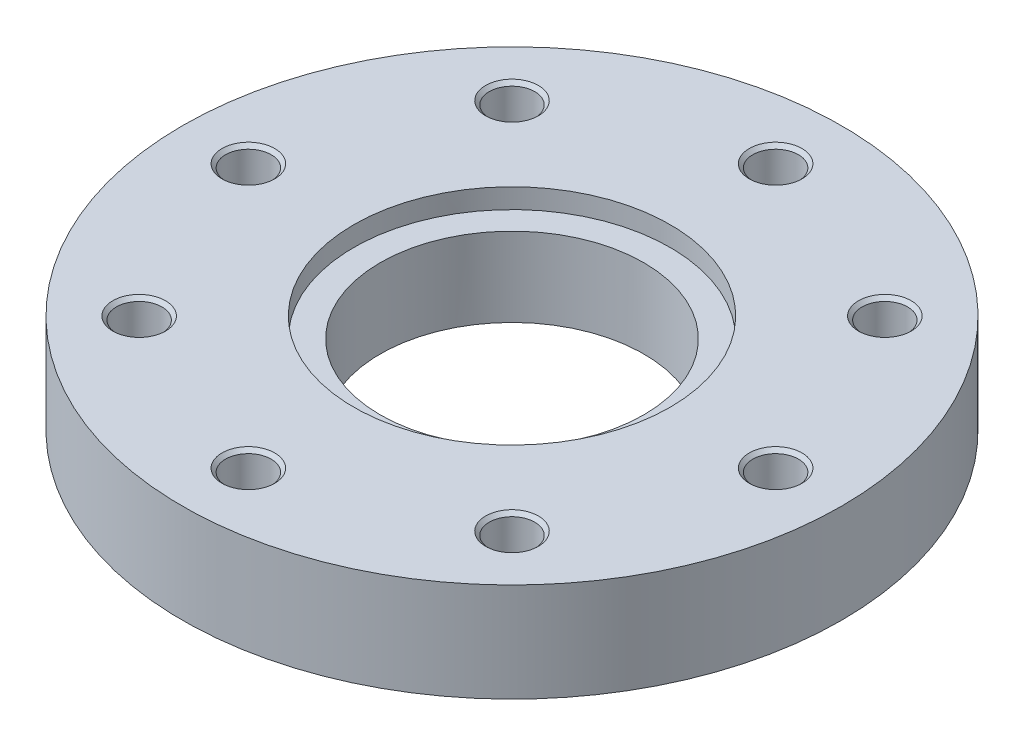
ISO-10303-21;
HEADER;
FILE_DESCRIPTION(('STEP AP214'),'2;1');
FILE_NAME('part.step','',(''),(''),'','','');
FILE_SCHEMA(('AUTOMOTIVE_DESIGN { 1 0 10303 214 1 1 1 1 }'));
ENDSEC;
DATA;
#1=APPLICATION_CONTEXT('core data for automotive mechanical design processes');
#2=APPLICATION_PROTOCOL_DEFINITION('international standard','automotive_design',2000,#1);
#3=PRODUCT_CONTEXT('',#1,'mechanical');
#4=PRODUCT('Part','Part','',(#3));
#5=PRODUCT_RELATED_PRODUCT_CATEGORY('part','',(#4));
#6=PRODUCT_DEFINITION_FORMATION('','',#4);
#7=PRODUCT_DEFINITION_CONTEXT('part definition',#1,'design');
#8=PRODUCT_DEFINITION('design','',#6,#7);
#9=PRODUCT_DEFINITION_SHAPE('','',#8);
#10=(LENGTH_UNIT() NAMED_UNIT(*) SI_UNIT(.MILLI.,.METRE.));
#11=(NAMED_UNIT(*) PLANE_ANGLE_UNIT() SI_UNIT($,.RADIAN.));
#12=(NAMED_UNIT(*) SI_UNIT($,.STERADIAN.) SOLID_ANGLE_UNIT());
#13=UNCERTAINTY_MEASURE_WITH_UNIT(LENGTH_MEASURE(1.E-05),#10,'distance_accuracy_value','');
#14=(GEOMETRIC_REPRESENTATION_CONTEXT(3) GLOBAL_UNCERTAINTY_ASSIGNED_CONTEXT((#13)) GLOBAL_UNIT_ASSIGNED_CONTEXT((#10,
#11,#12)) REPRESENTATION_CONTEXT('',''));
#15=CARTESIAN_POINT('',(0.,0.,0.));
#16=DIRECTION('',(0.,0.,1.));
#17=DIRECTION('',(1.,0.,0.));
#18=AXIS2_PLACEMENT_3D('',#15,#16,#17);
#19=CARTESIAN_POINT('',(0.,15.,0.));
#20=DIRECTION('',(0.,-1.,0.));
#21=DIRECTION('',(1.,0.,0.));
#22=AXIS2_PLACEMENT_3D('',#19,#20,#21);
#23=CYLINDRICAL_SURFACE('',#22,100.);
#24=CARTESIAN_POINT('',(0.,0.,0.));
#25=DIRECTION('',(0.,1.,0.));
#26=DIRECTION('',(1.,0.,0.));
#27=AXIS2_PLACEMENT_3D('',#24,#25,#26);
#28=CIRCLE('',#27,100.);
#29=CARTESIAN_POINT('',(100.,0.,0.));
#30=VERTEX_POINT('',#29);
#31=EDGE_CURVE('E9',#30,#30,#28,.T.);
#32=ORIENTED_EDGE('',*,*,#31,.T.);
#33=EDGE_LOOP('',(#32));
#34=FACE_BOUND('',#33,.T.);
#35=CARTESIAN_POINT('',(0.,30.,0.));
#36=DIRECTION('',(0.,1.,0.));
#37=DIRECTION('',(1.,0.,0.));
#38=AXIS2_PLACEMENT_3D('',#35,#36,#37);
#39=CIRCLE('',#38,100.);
#40=CARTESIAN_POINT('',(100.,30.,0.));
#41=VERTEX_POINT('',#40);
#42=EDGE_CURVE('E178',#41,#41,#39,.T.);
#43=ORIENTED_EDGE('',*,*,#42,.F.);
#44=EDGE_LOOP('',(#43));
#45=FACE_BOUND('',#44,.T.);
#46=ADVANCED_FACE('F15',(#34,#45),#23,.T.);
#47=CARTESIAN_POINT('',(70.,0.,0.));
#48=DIRECTION('',(0.,-1.,0.));
#49=DIRECTION('',(-1.,0.,0.));
#50=AXIS2_PLACEMENT_3D('',#47,#48,#49);
#51=PLANE('',#50);
#52=CARTESIAN_POINT('',(0.,0.,0.));
#53=DIRECTION('',(0.,1.,0.));
#54=DIRECTION('',(1.,0.,0.));
#55=AXIS2_PLACEMENT_3D('',#52,#53,#54);
#56=CIRCLE('',#55,40.);
#57=CARTESIAN_POINT('',(40.,0.,0.));
#58=VERTEX_POINT('',#57);
#59=EDGE_CURVE('E25',#58,#58,#56,.T.);
#60=ORIENTED_EDGE('',*,*,#59,.T.);
#61=EDGE_LOOP('',(#60));
#62=FACE_BOUND('',#61,.T.);
#63=ORIENTED_EDGE('',*,*,#31,.F.);
#64=EDGE_LOOP('',(#63));
#65=FACE_BOUND('',#64,.T.);
#66=ADVANCED_FACE('F269',(#62,#65),#51,.T.);
#67=CARTESIAN_POINT('',(0.,15.,0.));
#68=DIRECTION('',(0.,-1.,0.));
#69=DIRECTION('',(1.,0.,0.));
#70=AXIS2_PLACEMENT_3D('',#67,#68,#69);
#71=CYLINDRICAL_SURFACE('',#70,40.);
#72=ORIENTED_EDGE('',*,*,#59,.F.);
#73=EDGE_LOOP('',(#72));
#74=FACE_BOUND('',#73,.T.);
#75=CARTESIAN_POINT('',(0.,24.,0.));
#76=DIRECTION('',(0.,1.,0.));
#77=DIRECTION('',(1.,0.,0.));
#78=AXIS2_PLACEMENT_3D('',#75,#76,#77);
#79=CIRCLE('',#78,40.);
#80=CARTESIAN_POINT('',(-40.,24.,0.));
#81=VERTEX_POINT('',#80);
#82=EDGE_CURVE('E181',#81,#81,#79,.T.);
#83=ORIENTED_EDGE('',*,*,#82,.T.);
#84=EDGE_LOOP('',(#83));
#85=FACE_BOUND('',#84,.T.);
#86=ADVANCED_FACE('F274',(#74,#85),#71,.F.);
#87=CARTESIAN_POINT('',(70.,30.,0.));
#88=DIRECTION('',(0.,1.,0.));
#89=DIRECTION('',(1.,0.,0.));
#90=AXIS2_PLACEMENT_3D('',#87,#88,#89);
#91=PLANE('',#90);
#92=ORIENTED_EDGE('',*,*,#42,.T.);
#93=EDGE_LOOP('',(#92));
#94=FACE_BOUND('',#93,.T.);
#95=CARTESIAN_POINT('',(0.,30.,0.));
#96=DIRECTION('',(0.,-1.,0.));
#97=DIRECTION('',(1.,0.,0.));
#98=AXIS2_PLACEMENT_3D('',#95,#96,#97);
#99=CIRCLE('',#98,48.);
#100=CARTESIAN_POINT('',(-48.,30.,0.));
#101=VERTEX_POINT('',#100);
#102=EDGE_CURVE('E222',#101,#101,#99,.T.);
#103=ORIENTED_EDGE('',*,*,#102,.T.);
#104=EDGE_LOOP('',(#103));
#105=FACE_BOUND('',#104,.T.);
#106=CARTESIAN_POINT('',(80.,30.,0.));
#107=DIRECTION('',(0.,-1.,0.));
#108=DIRECTION('',(1.,0.,0.));
#109=AXIS2_PLACEMENT_3D('',#106,#107,#108);
#110=CIRCLE('',#109,8.);
#111=CARTESIAN_POINT('',(88.,30.,0.));
#112=VERTEX_POINT('',#111);
#113=EDGE_CURVE('E173',#112,#112,#110,.T.);
#114=ORIENTED_EDGE('',*,*,#113,.T.);
#115=EDGE_LOOP('',(#114));
#116=FACE_BOUND('',#115,.T.);
#117=CARTESIAN_POINT('',(56.5685424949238,30.,-56.5685424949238));
#118=DIRECTION('',(0.,-1.,0.));
#119=DIRECTION('',(0.707106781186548,0.,-0.707106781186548));
#120=AXIS2_PLACEMENT_3D('',#117,#118,#119);
#121=CIRCLE('',#120,8.);
#122=CARTESIAN_POINT('',(62.2253967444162,30.,-62.2253967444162));
#123=VERTEX_POINT('',#122);
#124=EDGE_CURVE('E137',#123,#123,#121,.T.);
#125=ORIENTED_EDGE('',*,*,#124,.T.);
#126=EDGE_LOOP('',(#125));
#127=FACE_BOUND('',#126,.T.);
#128=CARTESIAN_POINT('',(0.,30.,-80.));
#129=DIRECTION('',(0.,-1.,0.));
#130=DIRECTION('',(0.,0.,-1.));
#131=AXIS2_PLACEMENT_3D('',#128,#129,#130);
#132=CIRCLE('',#131,8.);
#133=CARTESIAN_POINT('',(0.,30.,-88.));
#134=VERTEX_POINT('',#133);
#135=EDGE_CURVE('E241',#134,#134,#132,.T.);
#136=ORIENTED_EDGE('',*,*,#135,.T.);
#137=EDGE_LOOP('',(#136));
#138=FACE_BOUND('',#137,.T.);
#139=CARTESIAN_POINT('',(-56.5685424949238,30.,-56.5685424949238));
#140=DIRECTION('',(0.,-1.,0.));
#141=DIRECTION('',(-0.707106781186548,0.,-0.707106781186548));
#142=AXIS2_PLACEMENT_3D('',#139,#140,#141);
#143=CIRCLE('',#142,8.);
#144=CARTESIAN_POINT('',(-62.2253967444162,30.,-62.2253967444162));
#145=VERTEX_POINT('',#144);
#146=EDGE_CURVE('E195',#145,#145,#143,.T.);
#147=ORIENTED_EDGE('',*,*,#146,.T.);
#148=EDGE_LOOP('',(#147));
#149=FACE_BOUND('',#148,.T.);
#150=CARTESIAN_POINT('',(-80.,30.,0.));
#151=DIRECTION('',(0.,-1.,0.));
#152=DIRECTION('',(-1.,0.,0.));
#153=AXIS2_PLACEMENT_3D('',#150,#151,#152);
#154=CIRCLE('',#153,8.);
#155=CARTESIAN_POINT('',(-88.,30.,0.));
#156=VERTEX_POINT('',#155);
#157=EDGE_CURVE('E489',#156,#156,#154,.T.);
#158=ORIENTED_EDGE('',*,*,#157,.T.);
#159=EDGE_LOOP('',(#158));
#160=FACE_BOUND('',#159,.T.);
#161=CARTESIAN_POINT('',(-56.5685424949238,30.,56.5685424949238));
#162=DIRECTION('',(0.,-1.,0.));
#163=DIRECTION('',(-0.707106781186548,0.,0.707106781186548));
#164=AXIS2_PLACEMENT_3D('',#161,#162,#163);
#165=CIRCLE('',#164,8.);
#166=CARTESIAN_POINT('',(-62.2253967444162,30.,62.2253967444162));
#167=VERTEX_POINT('',#166);
#168=EDGE_CURVE('E161',#167,#167,#165,.T.);
#169=ORIENTED_EDGE('',*,*,#168,.T.);
#170=EDGE_LOOP('',(#169));
#171=FACE_BOUND('',#170,.T.);
#172=CARTESIAN_POINT('',(0.,30.,80.));
#173=DIRECTION('',(0.,-1.,0.));
#174=DIRECTION('',(0.,0.,1.));
#175=AXIS2_PLACEMENT_3D('',#172,#173,#174);
#176=CIRCLE('',#175,8.);
#177=CARTESIAN_POINT('',(0.,30.,88.));
#178=VERTEX_POINT('',#177);
#179=EDGE_CURVE('E147',#178,#178,#176,.T.);
#180=ORIENTED_EDGE('',*,*,#179,.T.);
#181=EDGE_LOOP('',(#180));
#182=FACE_BOUND('',#181,.T.);
#183=CARTESIAN_POINT('',(56.5685424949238,30.,56.5685424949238));
#184=DIRECTION('',(0.,-1.,0.));
#185=DIRECTION('',(0.707106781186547,0.,0.707106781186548));
#186=AXIS2_PLACEMENT_3D('',#183,#184,#185);
#187=CIRCLE('',#186,8.);
#188=CARTESIAN_POINT('',(62.2253967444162,30.,62.2253967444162));
#189=VERTEX_POINT('',#188);
#190=EDGE_CURVE('E155',#189,#189,#187,.T.);
#191=ORIENTED_EDGE('',*,*,#190,.T.);
#192=EDGE_LOOP('',(#191));
#193=FACE_BOUND('',#192,.T.);
#194=ADVANCED_FACE('F393',(#94,#105,#116,#127,#138,#149,#160,#171,#182,#193),#91,.T.);
#195=CARTESIAN_POINT('',(0.,24.,0.));
#196=DIRECTION('',(0.,-1.,0.));
#197=DIRECTION('',(-1.,0.,0.));
#198=AXIS2_PLACEMENT_3D('',#195,#196,#197);
#199=PLANE('',#198);
#200=CARTESIAN_POINT('',(0.,24.,0.));
#201=DIRECTION('',(0.,-1.,0.));
#202=DIRECTION('',(1.,0.,0.));
#203=AXIS2_PLACEMENT_3D('',#200,#201,#202);
#204=CIRCLE('',#203,48.);
#205=CARTESIAN_POINT('',(48.,24.,0.));
#206=VERTEX_POINT('',#205);
#207=EDGE_CURVE('E225',#206,#206,#204,.T.);
#208=ORIENTED_EDGE('',*,*,#207,.F.);
#209=EDGE_LOOP('',(#208));
#210=FACE_BOUND('',#209,.T.);
#211=ORIENTED_EDGE('',*,*,#82,.F.);
#212=EDGE_LOOP('',(#211));
#213=FACE_BOUND('',#212,.T.);
#214=ADVANCED_FACE('F427',(#210,#213),#199,.F.);
#215=CARTESIAN_POINT('',(0.,28.5,0.));
#216=DIRECTION('',(0.,-1.,0.));
#217=DIRECTION('',(1.,0.,0.));
#218=AXIS2_PLACEMENT_3D('',#215,#216,#217);
#219=CYLINDRICAL_SURFACE('',#218,48.);
#220=ORIENTED_EDGE('',*,*,#207,.T.);
#221=EDGE_LOOP('',(#220));
#222=FACE_BOUND('',#221,.T.);
#223=ORIENTED_EDGE('',*,*,#102,.F.);
#224=EDGE_LOOP('',(#223));
#225=FACE_BOUND('',#224,.T.);
#226=ADVANCED_FACE('F402',(#222,#225),#219,.F.);
#227=CARTESIAN_POINT('',(80.,5.00308975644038,0.));
#228=DIRECTION('',(0.,1.,0.));
#229=DIRECTION('',(1.,0.,0.));
#230=AXIS2_PLACEMENT_3D('',#227,#228,#229);
#231=CONICAL_SURFACE('',#230,3.45875,1.0471975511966);
#232=CARTESIAN_POINT('',(80.,7.,0.));
#233=DIRECTION('',(0.,-1.,0.));
#234=DIRECTION('',(1.,0.,0.));
#235=AXIS2_PLACEMENT_3D('',#232,#233,#234);
#236=CIRCLE('',#235,6.9175);
#237=CARTESIAN_POINT('',(86.9175,7.,0.));
#238=VERTEX_POINT('',#237);
#239=EDGE_CURVE('E219',#238,#238,#236,.T.);
#240=ORIENTED_EDGE('',*,*,#239,.F.);
#241=EDGE_LOOP('',(#240));
#242=FACE_BOUND('',#241,.T.);
#243=CARTESIAN_POINT('',(80.,3.00617951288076,0.));
#244=VERTEX_POINT('',#243);
#245=VERTEX_LOOP('',#244);
#246=FACE_BOUND('',#245,.T.);
#247=ADVANCED_FACE('F399',(#242,#246),#231,.F.);
#248=CARTESIAN_POINT('',(80.,9.95875,0.));
#249=DIRECTION('',(0.,1.,0.));
#250=DIRECTION('',(1.,0.,0.));
#251=AXIS2_PLACEMENT_3D('',#248,#249,#250);
#252=CYLINDRICAL_SURFACE('',#251,6.9175);
#253=CARTESIAN_POINT('',(80.,12.9175,0.));
#254=DIRECTION('',(0.,-1.,0.));
#255=DIRECTION('',(1.,0.,0.));
#256=AXIS2_PLACEMENT_3D('',#253,#254,#255);
#257=CIRCLE('',#256,6.9175);
#258=CARTESIAN_POINT('',(86.9175,12.9175,0.));
#259=VERTEX_POINT('',#258);
#260=EDGE_CURVE('E223',#259,#259,#257,.T.);
#261=ORIENTED_EDGE('',*,*,#260,.F.);
#262=EDGE_LOOP('',(#261));
#263=FACE_BOUND('',#262,.T.);
#264=ORIENTED_EDGE('',*,*,#239,.T.);
#265=EDGE_LOOP('',(#264));
#266=FACE_BOUND('',#265,.T.);
#267=ADVANCED_FACE('F401',(#263,#266),#252,.F.);
#268=CARTESIAN_POINT('',(80.,13.45875,0.));
#269=DIRECTION('',(0.,1.,0.));
#270=DIRECTION('',(1.,0.,0.));
#271=AXIS2_PLACEMENT_3D('',#268,#269,#270);
#272=CONICAL_SURFACE('',#271,7.45875,0.785398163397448);
#273=CARTESIAN_POINT('',(80.,14.,0.));
#274=DIRECTION('',(0.,-1.,0.));
#275=DIRECTION('',(1.,0.,0.));
#276=AXIS2_PLACEMENT_3D('',#273,#274,#275);
#277=CIRCLE('',#276,8.);
#278=CARTESIAN_POINT('',(88.,14.,0.));
#279=VERTEX_POINT('',#278);
#280=EDGE_CURVE('E213',#279,#279,#277,.T.);
#281=ORIENTED_EDGE('',*,*,#280,.F.);
#282=EDGE_LOOP('',(#281));
#283=FACE_BOUND('',#282,.T.);
#284=ORIENTED_EDGE('',*,*,#260,.T.);
#285=EDGE_LOOP('',(#284));
#286=FACE_BOUND('',#285,.T.);
#287=ADVANCED_FACE('F383',(#283,#286),#272,.F.);
#288=CARTESIAN_POINT('',(87.45875,14.,0.));
#289=DIRECTION('',(0.,1.,0.));
#290=DIRECTION('',(-1.,0.,0.));
#291=AXIS2_PLACEMENT_3D('',#288,#289,#290);
#292=PLANE('',#291);
#293=CARTESIAN_POINT('',(80.,14.,0.));
#294=DIRECTION('',(0.,-1.,0.));
#295=DIRECTION('',(1.,0.,0.));
#296=AXIS2_PLACEMENT_3D('',#293,#294,#295);
#297=CIRCLE('',#296,6.9175);
#298=CARTESIAN_POINT('',(86.9175,14.,0.));
#299=VERTEX_POINT('',#298);
#300=EDGE_CURVE('E176',#299,#299,#297,.T.);
#301=ORIENTED_EDGE('',*,*,#300,.F.);
#302=EDGE_LOOP('',(#301));
#303=FACE_BOUND('',#302,.T.);
#304=ORIENTED_EDGE('',*,*,#280,.T.);
#305=EDGE_LOOP('',(#304));
#306=FACE_BOUND('',#305,.T.);
#307=ADVANCED_FACE('F285',(#303,#306),#292,.F.);
#308=CARTESIAN_POINT('',(80.,21.45875,0.));
#309=DIRECTION('',(0.,1.,0.));
#310=DIRECTION('',(1.,0.,0.));
#311=AXIS2_PLACEMENT_3D('',#308,#309,#310);
#312=CYLINDRICAL_SURFACE('',#311,6.9175);
#313=CARTESIAN_POINT('',(80.,28.9175,0.));
#314=DIRECTION('',(0.,-1.,0.));
#315=DIRECTION('',(1.,0.,0.));
#316=AXIS2_PLACEMENT_3D('',#313,#314,#315);
#317=CIRCLE('',#316,6.9175);
#318=CARTESIAN_POINT('',(86.9175,28.9175,0.));
#319=VERTEX_POINT('',#318);
#320=EDGE_CURVE('E177',#319,#319,#317,.T.);
#321=ORIENTED_EDGE('',*,*,#320,.F.);
#322=EDGE_LOOP('',(#321));
#323=FACE_BOUND('',#322,.T.);
#324=ORIENTED_EDGE('',*,*,#300,.T.);
#325=EDGE_LOOP('',(#324));
#326=FACE_BOUND('',#325,.T.);
#327=ADVANCED_FACE('F282',(#323,#326),#312,.F.);
#328=CARTESIAN_POINT('',(80.,29.45875,0.));
#329=DIRECTION('',(0.,1.,0.));
#330=DIRECTION('',(1.,0.,0.));
#331=AXIS2_PLACEMENT_3D('',#328,#329,#330);
#332=CONICAL_SURFACE('',#331,7.45875,0.785398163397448);
#333=ORIENTED_EDGE('',*,*,#113,.F.);
#334=EDGE_LOOP('',(#333));
#335=FACE_BOUND('',#334,.T.);
#336=ORIENTED_EDGE('',*,*,#320,.T.);
#337=EDGE_LOOP('',(#336));
#338=FACE_BOUND('',#337,.T.);
#339=ADVANCED_FACE('F284',(#335,#338),#332,.F.);
#340=CARTESIAN_POINT('',(56.5685424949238,5.00308975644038,-56.5685424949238));
#341=DIRECTION('',(0.,1.,0.));
#342=DIRECTION('',(0.707106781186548,0.,-0.707106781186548));
#343=AXIS2_PLACEMENT_3D('',#340,#341,#342);
#344=CONICAL_SURFACE('',#343,3.45875,1.0471975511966);
#345=CARTESIAN_POINT('',(56.5685424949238,7.,-56.5685424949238));
#346=DIRECTION('',(0.,-1.,0.));
#347=DIRECTION('',(0.707106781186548,0.,-0.707106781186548));
#348=AXIS2_PLACEMENT_3D('',#345,#346,#347);
#349=CIRCLE('',#348,6.9175);
#350=CARTESIAN_POINT('',(61.4599536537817,7.,-61.4599536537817));
#351=VERTEX_POINT('',#350);
#352=EDGE_CURVE('E190',#351,#351,#349,.T.);
#353=ORIENTED_EDGE('',*,*,#352,.F.);
#354=EDGE_LOOP('',(#353));
#355=FACE_BOUND('',#354,.T.);
#356=CARTESIAN_POINT('',(56.5685424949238,3.00617951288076,-56.5685424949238));
#357=VERTEX_POINT('',#356);
#358=VERTEX_LOOP('',#357);
#359=FACE_BOUND('',#358,.T.);
#360=ADVANCED_FACE('F441',(#355,#359),#344,.F.);
#361=CARTESIAN_POINT('',(56.5685424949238,9.95875,-56.5685424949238));
#362=DIRECTION('',(0.,1.,0.));
#363=DIRECTION('',(0.707106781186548,0.,-0.707106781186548));
#364=AXIS2_PLACEMENT_3D('',#361,#362,#363);
#365=CYLINDRICAL_SURFACE('',#364,6.9175);
#366=CARTESIAN_POINT('',(56.5685424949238,12.9175,-56.5685424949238));
#367=DIRECTION('',(0.,-1.,0.));
#368=DIRECTION('',(0.707106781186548,0.,-0.707106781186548));
#369=AXIS2_PLACEMENT_3D('',#366,#367,#368);
#370=CIRCLE('',#369,6.9175);
#371=CARTESIAN_POINT('',(61.4599536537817,12.9175,-61.4599536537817));
#372=VERTEX_POINT('',#371);
#373=EDGE_CURVE('E139',#372,#372,#370,.T.);
#374=ORIENTED_EDGE('',*,*,#373,.F.);
#375=EDGE_LOOP('',(#374));
#376=FACE_BOUND('',#375,.T.);
#377=ORIENTED_EDGE('',*,*,#352,.T.);
#378=EDGE_LOOP('',(#377));
#379=FACE_BOUND('',#378,.T.);
#380=ADVANCED_FACE('F413',(#376,#379),#365,.F.);
#381=CARTESIAN_POINT('',(56.5685424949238,13.45875,-56.5685424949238));
#382=DIRECTION('',(0.,1.,0.));
#383=DIRECTION('',(0.707106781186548,0.,-0.707106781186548));
#384=AXIS2_PLACEMENT_3D('',#381,#382,#383);
#385=CONICAL_SURFACE('',#384,7.45875,0.785398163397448);
#386=CARTESIAN_POINT('',(56.5685424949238,14.,-56.5685424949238));
#387=DIRECTION('',(0.,-1.,0.));
#388=DIRECTION('',(0.707106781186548,0.,-0.707106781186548));
#389=AXIS2_PLACEMENT_3D('',#386,#387,#388);
#390=CIRCLE('',#389,8.);
#391=CARTESIAN_POINT('',(62.2253967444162,14.,-62.2253967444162));
#392=VERTEX_POINT('',#391);
#393=EDGE_CURVE('E136',#392,#392,#390,.T.);
#394=ORIENTED_EDGE('',*,*,#393,.F.);
#395=EDGE_LOOP('',(#394));
#396=FACE_BOUND('',#395,.T.);
#397=ORIENTED_EDGE('',*,*,#373,.T.);
#398=EDGE_LOOP('',(#397));
#399=FACE_BOUND('',#398,.T.);
#400=ADVANCED_FACE('F375',(#396,#399),#385,.F.);
#401=CARTESIAN_POINT('',(61.842675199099,14.,-61.842675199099));
#402=DIRECTION('',(0.,1.,0.));
#403=DIRECTION('',(-0.707106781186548,0.,0.707106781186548));
#404=AXIS2_PLACEMENT_3D('',#401,#402,#403);
#405=PLANE('',#404);
#406=CARTESIAN_POINT('',(56.5685424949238,14.,-56.5685424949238));
#407=DIRECTION('',(0.,-1.,0.));
#408=DIRECTION('',(0.707106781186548,0.,-0.707106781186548));
#409=AXIS2_PLACEMENT_3D('',#406,#407,#408);
#410=CIRCLE('',#409,6.9175);
#411=CARTESIAN_POINT('',(61.4599536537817,14.,-61.4599536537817));
#412=VERTEX_POINT('',#411);
#413=EDGE_CURVE('E133',#412,#412,#410,.T.);
#414=ORIENTED_EDGE('',*,*,#413,.F.);
#415=EDGE_LOOP('',(#414));
#416=FACE_BOUND('',#415,.T.);
#417=ORIENTED_EDGE('',*,*,#393,.T.);
#418=EDGE_LOOP('',(#417));
#419=FACE_BOUND('',#418,.T.);
#420=ADVANCED_FACE('F367',(#416,#419),#405,.F.);
#421=CARTESIAN_POINT('',(56.5685424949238,21.45875,-56.5685424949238));
#422=DIRECTION('',(0.,1.,0.));
#423=DIRECTION('',(0.707106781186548,0.,-0.707106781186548));
#424=AXIS2_PLACEMENT_3D('',#421,#422,#423);
#425=CYLINDRICAL_SURFACE('',#424,6.9175);
#426=CARTESIAN_POINT('',(56.5685424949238,28.9175,-56.5685424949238));
#427=DIRECTION('',(0.,-1.,0.));
#428=DIRECTION('',(0.707106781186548,0.,-0.707106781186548));
#429=AXIS2_PLACEMENT_3D('',#426,#427,#428);
#430=CIRCLE('',#429,6.9175);
#431=CARTESIAN_POINT('',(61.4599536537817,28.9175,-61.4599536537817));
#432=VERTEX_POINT('',#431);
#433=EDGE_CURVE('E141',#432,#432,#430,.T.);
#434=ORIENTED_EDGE('',*,*,#433,.F.);
#435=EDGE_LOOP('',(#434));
#436=FACE_BOUND('',#435,.T.);
#437=ORIENTED_EDGE('',*,*,#413,.T.);
#438=EDGE_LOOP('',(#437));
#439=FACE_BOUND('',#438,.T.);
#440=ADVANCED_FACE('F134',(#436,#439),#425,.F.);
#441=CARTESIAN_POINT('',(56.5685424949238,29.45875,-56.5685424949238));
#442=DIRECTION('',(0.,1.,0.));
#443=DIRECTION('',(0.707106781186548,0.,-0.707106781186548));
#444=AXIS2_PLACEMENT_3D('',#441,#442,#443);
#445=CONICAL_SURFACE('',#444,7.45875,0.785398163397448);
#446=ORIENTED_EDGE('',*,*,#124,.F.);
#447=EDGE_LOOP('',(#446));
#448=FACE_BOUND('',#447,.T.);
#449=ORIENTED_EDGE('',*,*,#433,.T.);
#450=EDGE_LOOP('',(#449));
#451=FACE_BOUND('',#450,.T.);
#452=ADVANCED_FACE('F364',(#448,#451),#445,.F.);
#453=CARTESIAN_POINT('',(0.,5.00308975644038,-80.));
#454=DIRECTION('',(0.,1.,0.));
#455=DIRECTION('',(0.,0.,-1.));
#456=AXIS2_PLACEMENT_3D('',#453,#454,#455);
#457=CONICAL_SURFACE('',#456,3.45875,1.0471975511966);
#458=CARTESIAN_POINT('',(0.,7.,-80.));
#459=DIRECTION('',(0.,-1.,0.));
#460=DIRECTION('',(0.,0.,-1.));
#461=AXIS2_PLACEMENT_3D('',#458,#459,#460);
#462=CIRCLE('',#461,6.9175);
#463=CARTESIAN_POINT('',(0.,7.,-86.9175));
#464=VERTEX_POINT('',#463);
#465=EDGE_CURVE('E216',#464,#464,#462,.T.);
#466=ORIENTED_EDGE('',*,*,#465,.F.);
#467=EDGE_LOOP('',(#466));
#468=FACE_BOUND('',#467,.T.);
#469=CARTESIAN_POINT('',(0.,3.00617951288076,-80.));
#470=VERTEX_POINT('',#469);
#471=VERTEX_LOOP('',#470);
#472=FACE_BOUND('',#471,.T.);
#473=ADVANCED_FACE('F373',(#468,#472),#457,.F.);
#474=CARTESIAN_POINT('',(0.,9.95875,-80.));
#475=DIRECTION('',(0.,1.,0.));
#476=DIRECTION('',(0.,0.,-1.));
#477=AXIS2_PLACEMENT_3D('',#474,#475,#476);
#478=CYLINDRICAL_SURFACE('',#477,6.9175);
#479=CARTESIAN_POINT('',(0.,12.9175,-80.));
#480=DIRECTION('',(0.,-1.,0.));
#481=DIRECTION('',(0.,0.,-1.));
#482=AXIS2_PLACEMENT_3D('',#479,#480,#481);
#483=CIRCLE('',#482,6.9175);
#484=CARTESIAN_POINT('',(0.,12.9175,-86.9175));
#485=VERTEX_POINT('',#484);
#486=EDGE_CURVE('E171',#485,#485,#483,.T.);
#487=ORIENTED_EDGE('',*,*,#486,.F.);
#488=EDGE_LOOP('',(#487));
#489=FACE_BOUND('',#488,.T.);
#490=ORIENTED_EDGE('',*,*,#465,.T.);
#491=EDGE_LOOP('',(#490));
#492=FACE_BOUND('',#491,.T.);
#493=ADVANCED_FACE('F445',(#489,#492),#478,.F.);
#494=CARTESIAN_POINT('',(0.,13.45875,-80.));
#495=DIRECTION('',(0.,1.,0.));
#496=DIRECTION('',(0.,0.,-1.));
#497=AXIS2_PLACEMENT_3D('',#494,#495,#496);
#498=CONICAL_SURFACE('',#497,7.45875,0.785398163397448);
#499=CARTESIAN_POINT('',(0.,14.,-80.));
#500=DIRECTION('',(0.,-1.,0.));
#501=DIRECTION('',(0.,0.,-1.));
#502=AXIS2_PLACEMENT_3D('',#499,#500,#501);
#503=CIRCLE('',#502,8.);
#504=CARTESIAN_POINT('',(0.,14.,-88.));
#505=VERTEX_POINT('',#504);
#506=EDGE_CURVE('E169',#505,#505,#503,.T.);
#507=ORIENTED_EDGE('',*,*,#506,.F.);
#508=EDGE_LOOP('',(#507));
#509=FACE_BOUND('',#508,.T.);
#510=ORIENTED_EDGE('',*,*,#486,.T.);
#511=EDGE_LOOP('',(#510));
#512=FACE_BOUND('',#511,.T.);
#513=ADVANCED_FACE('F545',(#509,#512),#498,.F.);
#514=CARTESIAN_POINT('',(0.,14.,-87.45875));
#515=DIRECTION('',(0.,1.,0.));
#516=DIRECTION('',(0.,0.,1.));
#517=AXIS2_PLACEMENT_3D('',#514,#515,#516);
#518=PLANE('',#517);
#519=CARTESIAN_POINT('',(0.,14.,-80.));
#520=DIRECTION('',(0.,-1.,0.));
#521=DIRECTION('',(0.,0.,-1.));
#522=AXIS2_PLACEMENT_3D('',#519,#520,#521);
#523=CIRCLE('',#522,6.9175);
#524=CARTESIAN_POINT('',(0.,14.,-86.9175));
#525=VERTEX_POINT('',#524);
#526=EDGE_CURVE('E172',#525,#525,#523,.T.);
#527=ORIENTED_EDGE('',*,*,#526,.F.);
#528=EDGE_LOOP('',(#527));
#529=FACE_BOUND('',#528,.T.);
#530=ORIENTED_EDGE('',*,*,#506,.T.);
#531=EDGE_LOOP('',(#530));
#532=FACE_BOUND('',#531,.T.);
#533=ADVANCED_FACE('F541',(#529,#532),#518,.F.);
#534=CARTESIAN_POINT('',(0.,21.45875,-80.));
#535=DIRECTION('',(0.,1.,0.));
#536=DIRECTION('',(0.,0.,-1.));
#537=AXIS2_PLACEMENT_3D('',#534,#535,#536);
#538=CYLINDRICAL_SURFACE('',#537,6.9175);
#539=CARTESIAN_POINT('',(0.,28.9175,-80.));
#540=DIRECTION('',(0.,-1.,0.));
#541=DIRECTION('',(0.,0.,-1.));
#542=AXIS2_PLACEMENT_3D('',#539,#540,#541);
#543=CIRCLE('',#542,6.9175);
#544=CARTESIAN_POINT('',(0.,28.9175,-86.9175));
#545=VERTEX_POINT('',#544);
#546=EDGE_CURVE('E234',#545,#545,#543,.T.);
#547=ORIENTED_EDGE('',*,*,#546,.F.);
#548=EDGE_LOOP('',(#547));
#549=FACE_BOUND('',#548,.T.);
#550=ORIENTED_EDGE('',*,*,#526,.T.);
#551=EDGE_LOOP('',(#550));
#552=FACE_BOUND('',#551,.T.);
#553=ADVANCED_FACE('F538',(#549,#552),#538,.F.);
#554=CARTESIAN_POINT('',(0.,29.45875,-80.));
#555=DIRECTION('',(0.,1.,0.));
#556=DIRECTION('',(0.,0.,-1.));
#557=AXIS2_PLACEMENT_3D('',#554,#555,#556);
#558=CONICAL_SURFACE('',#557,7.45875,0.785398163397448);
#559=ORIENTED_EDGE('',*,*,#135,.F.);
#560=EDGE_LOOP('',(#559));
#561=FACE_BOUND('',#560,.T.);
#562=ORIENTED_EDGE('',*,*,#546,.T.);
#563=EDGE_LOOP('',(#562));
#564=FACE_BOUND('',#563,.T.);
#565=ADVANCED_FACE('F511',(#561,#564),#558,.F.);
#566=CARTESIAN_POINT('',(-56.5685424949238,5.00308975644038,-56.5685424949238));
#567=DIRECTION('',(0.,1.,0.));
#568=DIRECTION('',(-0.707106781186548,0.,-0.707106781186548));
#569=AXIS2_PLACEMENT_3D('',#566,#567,#568);
#570=CONICAL_SURFACE('',#569,3.45875,1.0471975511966);
#571=CARTESIAN_POINT('',(-56.5685424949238,7.,-56.5685424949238));
#572=DIRECTION('',(0.,-1.,0.));
#573=DIRECTION('',(-0.707106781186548,0.,-0.707106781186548));
#574=AXIS2_PLACEMENT_3D('',#571,#572,#573);
#575=CIRCLE('',#574,6.9175);
#576=CARTESIAN_POINT('',(-61.4599536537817,7.,-61.4599536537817));
#577=VERTEX_POINT('',#576);
#578=EDGE_CURVE('E231',#577,#577,#575,.T.);
#579=ORIENTED_EDGE('',*,*,#578,.F.);
#580=EDGE_LOOP('',(#579));
#581=FACE_BOUND('',#580,.T.);
#582=CARTESIAN_POINT('',(-56.5685424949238,3.00617951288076,-56.5685424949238));
#583=VERTEX_POINT('',#582);
#584=VERTEX_LOOP('',#583);
#585=FACE_BOUND('',#584,.T.);
#586=ADVANCED_FACE('F507',(#581,#585),#570,.F.);
#587=CARTESIAN_POINT('',(-56.5685424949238,9.95875,-56.5685424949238));
#588=DIRECTION('',(0.,1.,0.));
#589=DIRECTION('',(-0.707106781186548,0.,-0.707106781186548));
#590=AXIS2_PLACEMENT_3D('',#587,#588,#589);
#591=CYLINDRICAL_SURFACE('',#590,6.9175);
#592=CARTESIAN_POINT('',(-56.5685424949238,12.9175,-56.5685424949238));
#593=DIRECTION('',(0.,-1.,0.));
#594=DIRECTION('',(-0.707106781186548,0.,-0.707106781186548));
#595=AXIS2_PLACEMENT_3D('',#592,#593,#594);
#596=CIRCLE('',#595,6.9175);
#597=CARTESIAN_POINT('',(-61.4599536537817,12.9175,-61.4599536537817));
#598=VERTEX_POINT('',#597);
#599=EDGE_CURVE('E228',#598,#598,#596,.T.);
#600=ORIENTED_EDGE('',*,*,#599,.F.);
#601=EDGE_LOOP('',(#600));
#602=FACE_BOUND('',#601,.T.);
#603=ORIENTED_EDGE('',*,*,#578,.T.);
#604=EDGE_LOOP('',(#603));
#605=FACE_BOUND('',#604,.T.);
#606=ADVANCED_FACE('F510',(#602,#605),#591,.F.);
#607=CARTESIAN_POINT('',(-56.5685424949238,13.45875,-56.5685424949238));
#608=DIRECTION('',(0.,1.,0.));
#609=DIRECTION('',(-0.707106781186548,0.,-0.707106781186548));
#610=AXIS2_PLACEMENT_3D('',#607,#608,#609);
#611=CONICAL_SURFACE('',#610,7.45875,0.785398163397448);
#612=CARTESIAN_POINT('',(-56.5685424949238,14.,-56.5685424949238));
#613=DIRECTION('',(0.,-1.,0.));
#614=DIRECTION('',(-0.707106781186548,0.,-0.707106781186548));
#615=AXIS2_PLACEMENT_3D('',#612,#613,#614);
#616=CIRCLE('',#615,8.);
#617=CARTESIAN_POINT('',(-62.2253967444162,14.,-62.2253967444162));
#618=VERTEX_POINT('',#617);
#619=EDGE_CURVE('E194',#618,#618,#616,.T.);
#620=ORIENTED_EDGE('',*,*,#619,.F.);
#621=EDGE_LOOP('',(#620));
#622=FACE_BOUND('',#621,.T.);
#623=ORIENTED_EDGE('',*,*,#599,.T.);
#624=EDGE_LOOP('',(#623));
#625=FACE_BOUND('',#624,.T.);
#626=ADVANCED_FACE('F513',(#622,#625),#611,.F.);
#627=CARTESIAN_POINT('',(-61.842675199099,14.,-61.842675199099));
#628=DIRECTION('',(0.,1.,0.));
#629=DIRECTION('',(0.707106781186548,0.,0.707106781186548));
#630=AXIS2_PLACEMENT_3D('',#627,#628,#629);
#631=PLANE('',#630);
#632=CARTESIAN_POINT('',(-56.5685424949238,14.,-56.5685424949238));
#633=DIRECTION('',(0.,-1.,0.));
#634=DIRECTION('',(-0.707106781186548,0.,-0.707106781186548));
#635=AXIS2_PLACEMENT_3D('',#632,#633,#634);
#636=CIRCLE('',#635,6.9175);
#637=CARTESIAN_POINT('',(-61.4599536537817,14.,-61.4599536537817));
#638=VERTEX_POINT('',#637);
#639=EDGE_CURVE('E191',#638,#638,#636,.T.);
#640=ORIENTED_EDGE('',*,*,#639,.F.);
#641=EDGE_LOOP('',(#640));
#642=FACE_BOUND('',#641,.T.);
#643=ORIENTED_EDGE('',*,*,#619,.T.);
#644=EDGE_LOOP('',(#643));
#645=FACE_BOUND('',#644,.T.);
#646=ADVANCED_FACE('F409',(#642,#645),#631,.F.);
#647=CARTESIAN_POINT('',(-56.5685424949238,21.45875,-56.5685424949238));
#648=DIRECTION('',(0.,1.,0.));
#649=DIRECTION('',(-0.707106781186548,0.,-0.707106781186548));
#650=AXIS2_PLACEMENT_3D('',#647,#648,#649);
#651=CYLINDRICAL_SURFACE('',#650,6.9175);
#652=CARTESIAN_POINT('',(-56.5685424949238,28.9175,-56.5685424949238));
#653=DIRECTION('',(0.,-1.,0.));
#654=DIRECTION('',(-0.707106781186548,0.,-0.707106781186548));
#655=AXIS2_PLACEMENT_3D('',#652,#653,#654);
#656=CIRCLE('',#655,6.9175);
#657=CARTESIAN_POINT('',(-61.4599536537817,28.9175,-61.4599536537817));
#658=VERTEX_POINT('',#657);
#659=EDGE_CURVE('E205',#658,#658,#656,.T.);
#660=ORIENTED_EDGE('',*,*,#659,.F.);
#661=EDGE_LOOP('',(#660));
#662=FACE_BOUND('',#661,.T.);
#663=ORIENTED_EDGE('',*,*,#639,.T.);
#664=EDGE_LOOP('',(#663));
#665=FACE_BOUND('',#664,.T.);
#666=ADVANCED_FACE('F405',(#662,#665),#651,.F.);
#667=CARTESIAN_POINT('',(-56.5685424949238,29.45875,-56.5685424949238));
#668=DIRECTION('',(0.,1.,0.));
#669=DIRECTION('',(-0.707106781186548,0.,-0.707106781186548));
#670=AXIS2_PLACEMENT_3D('',#667,#668,#669);
#671=CONICAL_SURFACE('',#670,7.45875,0.785398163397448);
#672=ORIENTED_EDGE('',*,*,#146,.F.);
#673=EDGE_LOOP('',(#672));
#674=FACE_BOUND('',#673,.T.);
#675=ORIENTED_EDGE('',*,*,#659,.T.);
#676=EDGE_LOOP('',(#675));
#677=FACE_BOUND('',#676,.T.);
#678=ADVANCED_FACE('F408',(#674,#677),#671,.F.);
#679=CARTESIAN_POINT('',(-80.,5.00308975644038,0.));
#680=DIRECTION('',(0.,1.,0.));
#681=DIRECTION('',(-1.,0.,0.));
#682=AXIS2_PLACEMENT_3D('',#679,#680,#681);
#683=CONICAL_SURFACE('',#682,3.45875,1.0471975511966);
#684=CARTESIAN_POINT('',(-80.,7.,0.));
#685=DIRECTION('',(0.,-1.,0.));
#686=DIRECTION('',(-1.,0.,0.));
#687=AXIS2_PLACEMENT_3D('',#684,#685,#686);
#688=CIRCLE('',#687,6.9175);
#689=CARTESIAN_POINT('',(-86.9175,7.,0.));
#690=VERTEX_POINT('',#689);
#691=EDGE_CURVE('E184',#690,#690,#688,.T.);
#692=ORIENTED_EDGE('',*,*,#691,.F.);
#693=EDGE_LOOP('',(#692));
#694=FACE_BOUND('',#693,.T.);
#695=CARTESIAN_POINT('',(-80.,3.00617951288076,0.));
#696=VERTEX_POINT('',#695);
#697=VERTEX_LOOP('',#696);
#698=FACE_BOUND('',#697,.T.);
#699=ADVANCED_FACE('F423',(#694,#698),#683,.F.);
#700=CARTESIAN_POINT('',(-80.,9.95875,0.));
#701=DIRECTION('',(0.,1.,0.));
#702=DIRECTION('',(-1.,0.,0.));
#703=AXIS2_PLACEMENT_3D('',#700,#701,#702);
#704=CYLINDRICAL_SURFACE('',#703,6.9175);
#705=CARTESIAN_POINT('',(-80.,12.9175,0.));
#706=DIRECTION('',(0.,-1.,0.));
#707=DIRECTION('',(-1.,0.,0.));
#708=AXIS2_PLACEMENT_3D('',#705,#706,#707);
#709=CIRCLE('',#708,6.9175);
#710=CARTESIAN_POINT('',(-86.9175,12.9175,0.));
#711=VERTEX_POINT('',#710);
#712=EDGE_CURVE('E168',#711,#711,#709,.T.);
#713=ORIENTED_EDGE('',*,*,#712,.F.);
#714=EDGE_LOOP('',(#713));
#715=FACE_BOUND('',#714,.T.);
#716=ORIENTED_EDGE('',*,*,#691,.T.);
#717=EDGE_LOOP('',(#716));
#718=FACE_BOUND('',#717,.T.);
#719=ADVANCED_FACE('F434',(#715,#718),#704,.F.);
#720=CARTESIAN_POINT('',(-80.,13.45875,0.));
#721=DIRECTION('',(0.,1.,0.));
#722=DIRECTION('',(-1.,0.,0.));
#723=AXIS2_PLACEMENT_3D('',#720,#721,#722);
#724=CONICAL_SURFACE('',#723,7.45875,0.785398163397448);
#725=CARTESIAN_POINT('',(-80.,14.,0.));
#726=DIRECTION('',(0.,-1.,0.));
#727=DIRECTION('',(-1.,0.,0.));
#728=AXIS2_PLACEMENT_3D('',#725,#726,#727);
#729=CIRCLE('',#728,8.);
#730=CARTESIAN_POINT('',(-88.,14.,0.));
#731=VERTEX_POINT('',#730);
#732=EDGE_CURVE('E165',#731,#731,#729,.T.);
#733=ORIENTED_EDGE('',*,*,#732,.F.);
#734=EDGE_LOOP('',(#733));
#735=FACE_BOUND('',#734,.T.);
#736=ORIENTED_EDGE('',*,*,#712,.T.);
#737=EDGE_LOOP('',(#736));
#738=FACE_BOUND('',#737,.T.);
#739=ADVANCED_FACE('F436',(#735,#738),#724,.F.);
#740=CARTESIAN_POINT('',(-87.45875,14.,0.));
#741=DIRECTION('',(0.,1.,0.));
#742=DIRECTION('',(1.,0.,0.));
#743=AXIS2_PLACEMENT_3D('',#740,#741,#742);
#744=PLANE('',#743);
#745=CARTESIAN_POINT('',(-80.,14.,0.));
#746=DIRECTION('',(0.,-1.,0.));
#747=DIRECTION('',(-1.,0.,0.));
#748=AXIS2_PLACEMENT_3D('',#745,#746,#747);
#749=CIRCLE('',#748,6.9175);
#750=CARTESIAN_POINT('',(-86.9175,14.,0.));
#751=VERTEX_POINT('',#750);
#752=EDGE_CURVE('E145',#751,#751,#749,.T.);
#753=ORIENTED_EDGE('',*,*,#752,.F.);
#754=EDGE_LOOP('',(#753));
#755=FACE_BOUND('',#754,.T.);
#756=ORIENTED_EDGE('',*,*,#732,.T.);
#757=EDGE_LOOP('',(#756));
#758=FACE_BOUND('',#757,.T.);
#759=ADVANCED_FACE('F389',(#755,#758),#744,.F.);
#760=CARTESIAN_POINT('',(-80.,21.45875,0.));
#761=DIRECTION('',(0.,1.,0.));
#762=DIRECTION('',(-1.,0.,0.));
#763=AXIS2_PLACEMENT_3D('',#760,#761,#762);
#764=CYLINDRICAL_SURFACE('',#763,6.9175);
#765=CARTESIAN_POINT('',(-80.,28.9175,0.));
#766=DIRECTION('',(0.,-1.,0.));
#767=DIRECTION('',(-1.,0.,0.));
#768=AXIS2_PLACEMENT_3D('',#765,#766,#767);
#769=CIRCLE('',#768,6.9175);
#770=CARTESIAN_POINT('',(-86.9175,28.9175,0.));
#771=VERTEX_POINT('',#770);
#772=EDGE_CURVE('E200',#771,#771,#769,.T.);
#773=ORIENTED_EDGE('',*,*,#772,.F.);
#774=EDGE_LOOP('',(#773));
#775=FACE_BOUND('',#774,.T.);
#776=ORIENTED_EDGE('',*,*,#752,.T.);
#777=EDGE_LOOP('',(#776));
#778=FACE_BOUND('',#777,.T.);
#779=ADVANCED_FACE('F385',(#775,#778),#764,.F.);
#780=CARTESIAN_POINT('',(-80.,29.45875,0.));
#781=DIRECTION('',(0.,1.,0.));
#782=DIRECTION('',(-1.,0.,0.));
#783=AXIS2_PLACEMENT_3D('',#780,#781,#782);
#784=CONICAL_SURFACE('',#783,7.45875,0.785398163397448);
#785=ORIENTED_EDGE('',*,*,#157,.F.);
#786=EDGE_LOOP('',(#785));
#787=FACE_BOUND('',#786,.T.);
#788=ORIENTED_EDGE('',*,*,#772,.T.);
#789=EDGE_LOOP('',(#788));
#790=FACE_BOUND('',#789,.T.);
#791=ADVANCED_FACE('F388',(#787,#790),#784,.F.);
#792=CARTESIAN_POINT('',(-56.5685424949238,5.00308975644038,56.5685424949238));
#793=DIRECTION('',(0.,1.,0.));
#794=DIRECTION('',(-0.707106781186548,0.,0.707106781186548));
#795=AXIS2_PLACEMENT_3D('',#792,#793,#794);
#796=CONICAL_SURFACE('',#795,3.45875,1.0471975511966);
#797=CARTESIAN_POINT('',(-56.5685424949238,7.,56.5685424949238));
#798=DIRECTION('',(0.,-1.,0.));
#799=DIRECTION('',(-0.707106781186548,0.,0.707106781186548));
#800=AXIS2_PLACEMENT_3D('',#797,#798,#799);
#801=CIRCLE('',#800,6.9175);
#802=CARTESIAN_POINT('',(-61.4599536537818,7.,61.4599536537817));
#803=VERTEX_POINT('',#802);
#804=EDGE_CURVE('E197',#803,#803,#801,.T.);
#805=ORIENTED_EDGE('',*,*,#804,.F.);
#806=EDGE_LOOP('',(#805));
#807=FACE_BOUND('',#806,.T.);
#808=CARTESIAN_POINT('',(-56.5685424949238,3.00617951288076,56.5685424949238));
#809=VERTEX_POINT('',#808);
#810=VERTEX_LOOP('',#809);
#811=FACE_BOUND('',#810,.T.);
#812=ADVANCED_FACE('F453',(#807,#811),#796,.F.);
#813=CARTESIAN_POINT('',(-56.5685424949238,9.95875,56.5685424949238));
#814=DIRECTION('',(0.,1.,0.));
#815=DIRECTION('',(-0.707106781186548,0.,0.707106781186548));
#816=AXIS2_PLACEMENT_3D('',#813,#814,#815);
#817=CYLINDRICAL_SURFACE('',#816,6.9175);
#818=CARTESIAN_POINT('',(-56.5685424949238,12.9175,56.5685424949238));
#819=DIRECTION('',(0.,-1.,0.));
#820=DIRECTION('',(-0.707106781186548,0.,0.707106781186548));
#821=AXIS2_PLACEMENT_3D('',#818,#819,#820);
#822=CIRCLE('',#821,6.9175);
#823=CARTESIAN_POINT('',(-61.4599536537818,12.9175,61.4599536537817));
#824=VERTEX_POINT('',#823);
#825=EDGE_CURVE('E201',#824,#824,#822,.T.);
#826=ORIENTED_EDGE('',*,*,#825,.F.);
#827=EDGE_LOOP('',(#826));
#828=FACE_BOUND('',#827,.T.);
#829=ORIENTED_EDGE('',*,*,#804,.T.);
#830=EDGE_LOOP('',(#829));
#831=FACE_BOUND('',#830,.T.);
#832=ADVANCED_FACE('F379',(#828,#831),#817,.F.);
#833=CARTESIAN_POINT('',(-56.5685424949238,13.45875,56.5685424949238));
#834=DIRECTION('',(0.,1.,0.));
#835=DIRECTION('',(-0.707106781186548,0.,0.707106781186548));
#836=AXIS2_PLACEMENT_3D('',#833,#834,#835);
#837=CONICAL_SURFACE('',#836,7.45875,0.785398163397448);
#838=CARTESIAN_POINT('',(-56.5685424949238,14.,56.5685424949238));
#839=DIRECTION('',(0.,-1.,0.));
#840=DIRECTION('',(-0.707106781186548,0.,0.707106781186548));
#841=AXIS2_PLACEMENT_3D('',#838,#839,#840);
#842=CIRCLE('',#841,8.);
#843=CARTESIAN_POINT('',(-62.2253967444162,14.,62.2253967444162));
#844=VERTEX_POINT('',#843);
#845=EDGE_CURVE('E186',#844,#844,#842,.T.);
#846=ORIENTED_EDGE('',*,*,#845,.F.);
#847=EDGE_LOOP('',(#846));
#848=FACE_BOUND('',#847,.T.);
#849=ORIENTED_EDGE('',*,*,#825,.T.);
#850=EDGE_LOOP('',(#849));
#851=FACE_BOUND('',#850,.T.);
#852=ADVANCED_FACE('F432',(#848,#851),#837,.F.);
#853=CARTESIAN_POINT('',(-61.842675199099,14.,61.842675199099));
#854=DIRECTION('',(0.,1.,0.));
#855=DIRECTION('',(0.707106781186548,0.,-0.707106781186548));
#856=AXIS2_PLACEMENT_3D('',#853,#854,#855);
#857=PLANE('',#856);
#858=CARTESIAN_POINT('',(-56.5685424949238,14.,56.5685424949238));
#859=DIRECTION('',(0.,-1.,0.));
#860=DIRECTION('',(-0.707106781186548,0.,0.707106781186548));
#861=AXIS2_PLACEMENT_3D('',#858,#859,#860);
#862=CIRCLE('',#861,6.9175);
#863=CARTESIAN_POINT('',(-61.4599536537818,14.,61.4599536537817));
#864=VERTEX_POINT('',#863);
#865=EDGE_CURVE('E164',#864,#864,#862,.T.);
#866=ORIENTED_EDGE('',*,*,#865,.F.);
#867=EDGE_LOOP('',(#866));
#868=FACE_BOUND('',#867,.T.);
#869=ORIENTED_EDGE('',*,*,#845,.T.);
#870=EDGE_LOOP('',(#869));
#871=FACE_BOUND('',#870,.T.);
#872=ADVANCED_FACE('F429',(#868,#871),#857,.F.);
#873=CARTESIAN_POINT('',(-56.5685424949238,21.45875,56.5685424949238));
#874=DIRECTION('',(0.,1.,0.));
#875=DIRECTION('',(-0.707106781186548,0.,0.707106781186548));
#876=AXIS2_PLACEMENT_3D('',#873,#874,#875);
#877=CYLINDRICAL_SURFACE('',#876,6.9175);
#878=CARTESIAN_POINT('',(-56.5685424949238,28.9175,56.5685424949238));
#879=DIRECTION('',(0.,-1.,0.));
#880=DIRECTION('',(-0.707106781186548,0.,0.707106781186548));
#881=AXIS2_PLACEMENT_3D('',#878,#879,#880);
#882=CIRCLE('',#881,6.9175);
#883=CARTESIAN_POINT('',(-61.4599536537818,28.9175,61.4599536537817));
#884=VERTEX_POINT('',#883);
#885=EDGE_CURVE('E159',#884,#884,#882,.T.);
#886=ORIENTED_EDGE('',*,*,#885,.F.);
#887=EDGE_LOOP('',(#886));
#888=FACE_BOUND('',#887,.T.);
#889=ORIENTED_EDGE('',*,*,#865,.T.);
#890=EDGE_LOOP('',(#889));
#891=FACE_BOUND('',#890,.T.);
#892=ADVANCED_FACE('F397',(#888,#891),#877,.F.);
#893=CARTESIAN_POINT('',(-56.5685424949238,29.45875,56.5685424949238));
#894=DIRECTION('',(0.,1.,0.));
#895=DIRECTION('',(-0.707106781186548,0.,0.707106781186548));
#896=AXIS2_PLACEMENT_3D('',#893,#894,#895);
#897=CONICAL_SURFACE('',#896,7.45875,0.785398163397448);
#898=ORIENTED_EDGE('',*,*,#168,.F.);
#899=EDGE_LOOP('',(#898));
#900=FACE_BOUND('',#899,.T.);
#901=ORIENTED_EDGE('',*,*,#885,.T.);
#902=EDGE_LOOP('',(#901));
#903=FACE_BOUND('',#902,.T.);
#904=ADVANCED_FACE('F311',(#900,#903),#897,.F.);
#905=CARTESIAN_POINT('',(0.,5.00308975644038,80.));
#906=DIRECTION('',(0.,1.,0.));
#907=DIRECTION('',(0.,0.,1.));
#908=AXIS2_PLACEMENT_3D('',#905,#906,#907);
#909=CONICAL_SURFACE('',#908,3.45875,1.0471975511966);
#910=CARTESIAN_POINT('',(0.,7.,80.));
#911=DIRECTION('',(0.,-1.,0.));
#912=DIRECTION('',(0.,0.,1.));
#913=AXIS2_PLACEMENT_3D('',#910,#911,#912);
#914=CIRCLE('',#913,6.9175);
#915=CARTESIAN_POINT('',(0.,7.,86.9175));
#916=VERTEX_POINT('',#915);
#917=EDGE_CURVE('E156',#916,#916,#914,.T.);
#918=ORIENTED_EDGE('',*,*,#917,.F.);
#919=EDGE_LOOP('',(#918));
#920=FACE_BOUND('',#919,.T.);
#921=CARTESIAN_POINT('',(0.,3.00617951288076,80.));
#922=VERTEX_POINT('',#921);
#923=VERTEX_LOOP('',#922);
#924=FACE_BOUND('',#923,.T.);
#925=ADVANCED_FACE('F297',(#920,#924),#909,.F.);
#926=CARTESIAN_POINT('',(0.,9.95875,80.));
#927=DIRECTION('',(0.,1.,0.));
#928=DIRECTION('',(0.,0.,1.));
#929=AXIS2_PLACEMENT_3D('',#926,#927,#928);
#930=CYLINDRICAL_SURFACE('',#929,6.9175);
#931=CARTESIAN_POINT('',(0.,12.9175,80.));
#932=DIRECTION('',(0.,-1.,0.));
#933=DIRECTION('',(0.,0.,1.));
#934=AXIS2_PLACEMENT_3D('',#931,#932,#933);
#935=CIRCLE('',#934,6.9175);
#936=CARTESIAN_POINT('',(0.,12.9175,86.9175));
#937=VERTEX_POINT('',#936);
#938=EDGE_CURVE('E160',#937,#937,#935,.T.);
#939=ORIENTED_EDGE('',*,*,#938,.F.);
#940=EDGE_LOOP('',(#939));
#941=FACE_BOUND('',#940,.T.);
#942=ORIENTED_EDGE('',*,*,#917,.T.);
#943=EDGE_LOOP('',(#942));
#944=FACE_BOUND('',#943,.T.);
#945=ADVANCED_FACE('F280',(#941,#944),#930,.F.);
#946=CARTESIAN_POINT('',(0.,13.45875,80.));
#947=DIRECTION('',(0.,1.,0.));
#948=DIRECTION('',(0.,0.,1.));
#949=AXIS2_PLACEMENT_3D('',#946,#947,#948);
#950=CONICAL_SURFACE('',#949,7.45875,0.785398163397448);
#951=CARTESIAN_POINT('',(0.,14.,80.));
#952=DIRECTION('',(0.,-1.,0.));
#953=DIRECTION('',(0.,0.,1.));
#954=AXIS2_PLACEMENT_3D('',#951,#952,#953);
#955=CIRCLE('',#954,8.);
#956=CARTESIAN_POINT('',(0.,14.,88.));
#957=VERTEX_POINT('',#956);
#958=EDGE_CURVE('E19',#957,#957,#955,.T.);
#959=ORIENTED_EDGE('',*,*,#958,.F.);
#960=EDGE_LOOP('',(#959));
#961=FACE_BOUND('',#960,.T.);
#962=ORIENTED_EDGE('',*,*,#938,.T.);
#963=EDGE_LOOP('',(#962));
#964=FACE_BOUND('',#963,.T.);
#965=ADVANCED_FACE('F287',(#961,#964),#950,.F.);
#966=CARTESIAN_POINT('',(0.,14.,87.45875));
#967=DIRECTION('',(0.,1.,0.));
#968=DIRECTION('',(0.,0.,-1.));
#969=AXIS2_PLACEMENT_3D('',#966,#967,#968);
#970=PLANE('',#969);
#971=CARTESIAN_POINT('',(0.,14.,80.));
#972=DIRECTION('',(0.,-1.,0.));
#973=DIRECTION('',(0.,0.,1.));
#974=AXIS2_PLACEMENT_3D('',#971,#972,#973);
#975=CIRCLE('',#974,6.9175);
#976=CARTESIAN_POINT('',(0.,14.,86.9175));
#977=VERTEX_POINT('',#976);
#978=EDGE_CURVE('E149',#977,#977,#975,.T.);
#979=ORIENTED_EDGE('',*,*,#978,.F.);
#980=EDGE_LOOP('',(#979));
#981=FACE_BOUND('',#980,.T.);
#982=ORIENTED_EDGE('',*,*,#958,.T.);
#983=EDGE_LOOP('',(#982));
#984=FACE_BOUND('',#983,.T.);
#985=ADVANCED_FACE('F289',(#981,#984),#970,.F.);
#986=CARTESIAN_POINT('',(0.,21.45875,80.));
#987=DIRECTION('',(0.,1.,0.));
#988=DIRECTION('',(0.,0.,1.));
#989=AXIS2_PLACEMENT_3D('',#986,#987,#988);
#990=CYLINDRICAL_SURFACE('',#989,6.9175);
#991=CARTESIAN_POINT('',(0.,28.9175,80.));
#992=DIRECTION('',(0.,-1.,0.));
#993=DIRECTION('',(0.,0.,1.));
#994=AXIS2_PLACEMENT_3D('',#991,#992,#993);
#995=CIRCLE('',#994,6.9175);
#996=CARTESIAN_POINT('',(0.,28.9175,86.9175));
#997=VERTEX_POINT('',#996);
#998=EDGE_CURVE('E150',#997,#997,#995,.T.);
#999=ORIENTED_EDGE('',*,*,#998,.F.);
#1000=EDGE_LOOP('',(#999));
#1001=FACE_BOUND('',#1000,.T.);
#1002=ORIENTED_EDGE('',*,*,#978,.T.);
#1003=EDGE_LOOP('',(#1002));
#1004=FACE_BOUND('',#1003,.T.);
#1005=ADVANCED_FACE('F264',(#1001,#1004),#990,.F.);
#1006=CARTESIAN_POINT('',(0.,29.45875,80.));
#1007=DIRECTION('',(0.,1.,0.));
#1008=DIRECTION('',(0.,0.,1.));
#1009=AXIS2_PLACEMENT_3D('',#1006,#1007,#1008);
#1010=CONICAL_SURFACE('',#1009,7.45875,0.785398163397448);
#1011=ORIENTED_EDGE('',*,*,#179,.F.);
#1012=EDGE_LOOP('',(#1011));
#1013=FACE_BOUND('',#1012,.T.);
#1014=ORIENTED_EDGE('',*,*,#998,.T.);
#1015=EDGE_LOOP('',(#1014));
#1016=FACE_BOUND('',#1015,.T.);
#1017=ADVANCED_FACE('F17',(#1013,#1016),#1010,.F.);
#1018=CARTESIAN_POINT('',(56.5685424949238,5.00308975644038,56.5685424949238));
#1019=DIRECTION('',(0.,1.,0.));
#1020=DIRECTION('',(0.707106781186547,0.,0.707106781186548));
#1021=AXIS2_PLACEMENT_3D('',#1018,#1019,#1020);
#1022=CONICAL_SURFACE('',#1021,3.45875,1.0471975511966);
#1023=CARTESIAN_POINT('',(56.5685424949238,7.,56.5685424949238));
#1024=DIRECTION('',(0.,-1.,0.));
#1025=DIRECTION('',(0.707106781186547,0.,0.707106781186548));
#1026=AXIS2_PLACEMENT_3D('',#1023,#1024,#1025);
#1027=CIRCLE('',#1026,6.9175);
#1028=CARTESIAN_POINT('',(61.4599536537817,7.,61.4599536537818));
#1029=VERTEX_POINT('',#1028);
#1030=EDGE_CURVE('E152',#1029,#1029,#1027,.T.);
#1031=ORIENTED_EDGE('',*,*,#1030,.F.);
#1032=EDGE_LOOP('',(#1031));
#1033=FACE_BOUND('',#1032,.T.);
#1034=CARTESIAN_POINT('',(56.5685424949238,3.00617951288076,56.5685424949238));
#1035=VERTEX_POINT('',#1034);
#1036=VERTEX_LOOP('',#1035);
#1037=FACE_BOUND('',#1036,.T.);
#1038=ADVANCED_FACE('F252',(#1033,#1037),#1022,.F.);
#1039=CARTESIAN_POINT('',(56.5685424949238,9.95875,56.5685424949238));
#1040=DIRECTION('',(0.,1.,0.));
#1041=DIRECTION('',(0.707106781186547,0.,0.707106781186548));
#1042=AXIS2_PLACEMENT_3D('',#1039,#1040,#1041);
#1043=CYLINDRICAL_SURFACE('',#1042,6.9175);
#1044=CARTESIAN_POINT('',(56.5685424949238,12.9175,56.5685424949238));
#1045=DIRECTION('',(0.,-1.,0.));
#1046=DIRECTION('',(0.707106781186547,0.,0.707106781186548));
#1047=AXIS2_PLACEMENT_3D('',#1044,#1045,#1046);
#1048=CIRCLE('',#1047,6.9175);
#1049=CARTESIAN_POINT('',(61.4599536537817,12.9175,61.4599536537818));
#1050=VERTEX_POINT('',#1049);
#1051=EDGE_CURVE('E84',#1050,#1050,#1048,.T.);
#1052=ORIENTED_EDGE('',*,*,#1051,.F.);
#1053=EDGE_LOOP('',(#1052));
#1054=FACE_BOUND('',#1053,.T.);
#1055=ORIENTED_EDGE('',*,*,#1030,.T.);
#1056=EDGE_LOOP('',(#1055));
#1057=FACE_BOUND('',#1056,.T.);
#1058=ADVANCED_FACE('F250',(#1054,#1057),#1043,.F.);
#1059=CARTESIAN_POINT('',(56.5685424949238,13.45875,56.5685424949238));
#1060=DIRECTION('',(0.,1.,0.));
#1061=DIRECTION('',(0.707106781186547,0.,0.707106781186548));
#1062=AXIS2_PLACEMENT_3D('',#1059,#1060,#1061);
#1063=CONICAL_SURFACE('',#1062,7.45875,0.785398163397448);
#1064=CARTESIAN_POINT('',(56.5685424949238,14.,56.5685424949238));
#1065=DIRECTION('',(0.,-1.,0.));
#1066=DIRECTION('',(0.707106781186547,0.,0.707106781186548));
#1067=AXIS2_PLACEMENT_3D('',#1064,#1065,#1066);
#1068=CIRCLE('',#1067,8.);
#1069=CARTESIAN_POINT('',(62.2253967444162,14.,62.2253967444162));
#1070=VERTEX_POINT('',#1069);
#1071=EDGE_CURVE('E90',#1070,#1070,#1068,.T.);
#1072=ORIENTED_EDGE('',*,*,#1071,.F.);
#1073=EDGE_LOOP('',(#1072));
#1074=FACE_BOUND('',#1073,.T.);
#1075=ORIENTED_EDGE('',*,*,#1051,.T.);
#1076=EDGE_LOOP('',(#1075));
#1077=FACE_BOUND('',#1076,.T.);
#1078=ADVANCED_FACE('F261',(#1074,#1077),#1063,.F.);
#1079=CARTESIAN_POINT('',(61.8426751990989,14.,61.842675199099));
#1080=DIRECTION('',(0.,1.,0.));
#1081=DIRECTION('',(-0.707106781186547,0.,-0.707106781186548));
#1082=AXIS2_PLACEMENT_3D('',#1079,#1080,#1081);
#1083=PLANE('',#1082);
#1084=CARTESIAN_POINT('',(56.5685424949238,14.,56.5685424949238));
#1085=DIRECTION('',(0.,-1.,0.));
#1086=DIRECTION('',(0.707106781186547,0.,0.707106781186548));
#1087=AXIS2_PLACEMENT_3D('',#1084,#1085,#1086);
#1088=CIRCLE('',#1087,6.9175);
#1089=CARTESIAN_POINT('',(61.4599536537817,14.,61.4599536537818));
#1090=VERTEX_POINT('',#1089);
#1091=EDGE_CURVE('E153',#1090,#1090,#1088,.T.);
#1092=ORIENTED_EDGE('',*,*,#1091,.F.);
#1093=EDGE_LOOP('',(#1092));
#1094=FACE_BOUND('',#1093,.T.);
#1095=ORIENTED_EDGE('',*,*,#1071,.T.);
#1096=EDGE_LOOP('',(#1095));
#1097=FACE_BOUND('',#1096,.T.);
#1098=ADVANCED_FACE('F419',(#1094,#1097),#1083,.F.);
#1099=CARTESIAN_POINT('',(56.5685424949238,21.45875,56.5685424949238));
#1100=DIRECTION('',(0.,1.,0.));
#1101=DIRECTION('',(0.707106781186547,0.,0.707106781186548));
#1102=AXIS2_PLACEMENT_3D('',#1099,#1100,#1101);
#1103=CYLINDRICAL_SURFACE('',#1102,6.9175);
#1104=CARTESIAN_POINT('',(56.5685424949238,28.9175,56.5685424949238));
#1105=DIRECTION('',(0.,-1.,0.));
#1106=DIRECTION('',(0.707106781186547,0.,0.707106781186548));
#1107=AXIS2_PLACEMENT_3D('',#1104,#1105,#1106);
#1108=CIRCLE('',#1107,6.9175);
#1109=CARTESIAN_POINT('',(61.4599536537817,28.9175,61.4599536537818));
#1110=VERTEX_POINT('',#1109);
#1111=EDGE_CURVE('E237',#1110,#1110,#1108,.T.);
#1112=ORIENTED_EDGE('',*,*,#1111,.F.);
#1113=EDGE_LOOP('',(#1112));
#1114=FACE_BOUND('',#1113,.T.);
#1115=ORIENTED_EDGE('',*,*,#1091,.T.);
#1116=EDGE_LOOP('',(#1115));
#1117=FACE_BOUND('',#1116,.T.);
#1118=ADVANCED_FACE('F415',(#1114,#1117),#1103,.F.);
#1119=CARTESIAN_POINT('',(56.5685424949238,29.45875,56.5685424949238));
#1120=DIRECTION('',(0.,1.,0.));
#1121=DIRECTION('',(0.707106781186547,0.,0.707106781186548));
#1122=AXIS2_PLACEMENT_3D('',#1119,#1120,#1121);
#1123=CONICAL_SURFACE('',#1122,7.45875,0.785398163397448);
#1124=ORIENTED_EDGE('',*,*,#190,.F.);
#1125=EDGE_LOOP('',(#1124));
#1126=FACE_BOUND('',#1125,.T.);
#1127=ORIENTED_EDGE('',*,*,#1111,.T.);
#1128=EDGE_LOOP('',(#1127));
#1129=FACE_BOUND('',#1128,.T.);
#1130=ADVANCED_FACE('F418',(#1126,#1129),#1123,.F.);
#1131=CLOSED_SHELL('',(#46,#66,#86,#194,#214,#226,#247,#267,#287,#307,#327,#339,#360,#380,#400,
#420,#440,#452,#473,#493,#513,#533,#553,#565,#586,#606,#626,#646,#666,#678,#699,#719,#739,#759,
#779,#791,#812,#832,#852,#872,#892,#904,#925,#945,#965,#985,#1005,#1017,#1038,#1058,#1078,#1098,
#1118,#1130));
#1132=MANIFOLD_SOLID_BREP('B1',#1131);
#1133=ADVANCED_BREP_SHAPE_REPRESENTATION('',(#18,#1132),#14);
#1134=SHAPE_DEFINITION_REPRESENTATION(#9,#1133);
ENDSEC;
END-ISO-10303-21;
